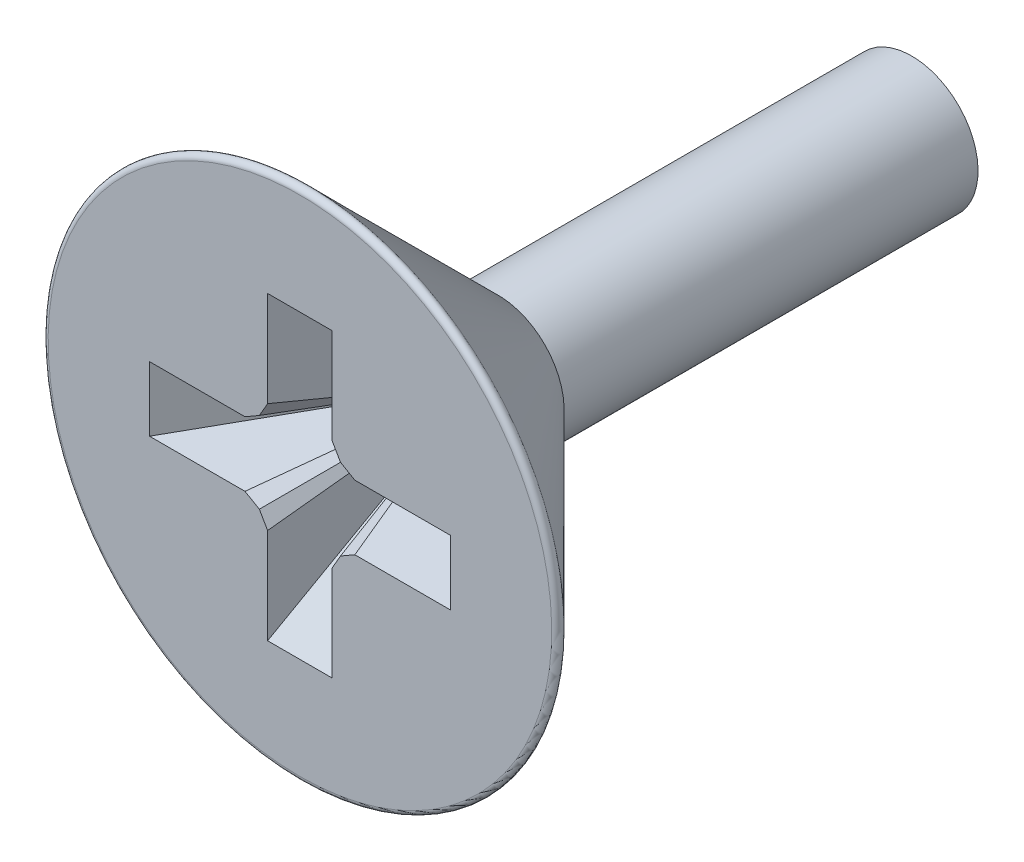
ISO-10303-21;
HEADER;
FILE_DESCRIPTION(('STEP AP214'),'2;1');
FILE_NAME('part.step','',(''),(''),'','','');
FILE_SCHEMA(('AUTOMOTIVE_DESIGN { 1 0 10303 214 1 1 1 1 }'));
ENDSEC;
DATA;
#1=APPLICATION_CONTEXT('core data for automotive mechanical design processes');
#2=APPLICATION_PROTOCOL_DEFINITION('international standard','automotive_design',2000,#1);
#3=PRODUCT_CONTEXT('',#1,'mechanical');
#4=PRODUCT('Part','Part','',(#3));
#5=PRODUCT_RELATED_PRODUCT_CATEGORY('part','',(#4));
#6=PRODUCT_DEFINITION_FORMATION('','',#4);
#7=PRODUCT_DEFINITION_CONTEXT('part definition',#1,'design');
#8=PRODUCT_DEFINITION('design','',#6,#7);
#9=PRODUCT_DEFINITION_SHAPE('','',#8);
#10=(LENGTH_UNIT() NAMED_UNIT(*) SI_UNIT(.MILLI.,.METRE.));
#11=(NAMED_UNIT(*) PLANE_ANGLE_UNIT() SI_UNIT($,.RADIAN.));
#12=(NAMED_UNIT(*) SI_UNIT($,.STERADIAN.) SOLID_ANGLE_UNIT());
#13=UNCERTAINTY_MEASURE_WITH_UNIT(LENGTH_MEASURE(1.E-05),#10,'distance_accuracy_value','');
#14=(GEOMETRIC_REPRESENTATION_CONTEXT(3) GLOBAL_UNCERTAINTY_ASSIGNED_CONTEXT((#13)) GLOBAL_UNIT_ASSIGNED_CONTEXT((#10,
#11,#12)) REPRESENTATION_CONTEXT('',''));
#15=CARTESIAN_POINT('',(0.,0.,0.));
#16=DIRECTION('',(0.,0.,1.));
#17=DIRECTION('',(1.,0.,0.));
#18=AXIS2_PLACEMENT_3D('',#15,#16,#17);
#19=CARTESIAN_POINT('',(0.,0.,-0.0839999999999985));
#20=DIRECTION('',(0.,0.,1.));
#21=DIRECTION('',(0.,-1.,0.));
#22=AXIS2_PLACEMENT_3D('',#19,#20,#21);
#23=TOROIDAL_SURFACE('',#22,4.116,0.0840000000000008);
#24=CARTESIAN_POINT('',(0.,0.,0.));
#25=DIRECTION('',(0.,0.,1.));
#26=DIRECTION('',(0.,-1.,0.));
#27=AXIS2_PLACEMENT_3D('',#24,#25,#26);
#28=CIRCLE('',#27,4.116);
#29=CARTESIAN_POINT('',(0.,-4.116,0.));
#30=VERTEX_POINT('',#29);
#31=EDGE_CURVE('E12',#30,#30,#28,.T.);
#32=ORIENTED_EDGE('',*,*,#31,.F.);
#33=EDGE_LOOP('',(#32));
#34=FACE_BOUND('',#33,.T.);
#35=CARTESIAN_POINT('',(0.,0.,-0.14339696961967));
#36=DIRECTION('',(0.,0.,1.));
#37=DIRECTION('',(0.,-1.,0.));
#38=AXIS2_PLACEMENT_3D('',#35,#36,#37);
#39=CIRCLE('',#38,4.17539696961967);
#40=CARTESIAN_POINT('',(0.,-4.17539696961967,-0.143396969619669));
#41=VERTEX_POINT('',#40);
#42=EDGE_CURVE('E228',#41,#41,#39,.T.);
#43=ORIENTED_EDGE('',*,*,#42,.T.);
#44=EDGE_LOOP('',(#43));
#45=FACE_BOUND('',#44,.T.);
#46=ADVANCED_FACE('F47',(#34,#45),#23,.T.);
#47=CARTESIAN_POINT('',(0.,4.116,0.));
#48=DIRECTION('',(0.,0.,-1.));
#49=DIRECTION('',(0.,1.,0.));
#50=AXIS2_PLACEMENT_3D('',#47,#48,#49);
#51=PLANE('',#50);
#52=DIRECTION('',(0.,1.,0.));
#53=VECTOR('',#52,1.);
#54=CARTESIAN_POINT('',(0.528066,-1.678120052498,0.));
#55=LINE('',#54,#53);
#56=CARTESIAN_POINT('',(0.528066,-2.458527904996,0.));
#57=VERTEX_POINT('',#56);
#58=CARTESIAN_POINT('',(0.528066,-0.8977122,0.));
#59=VERTEX_POINT('',#58);
#60=EDGE_CURVE('E331',#57,#59,#55,.T.);
#61=ORIENTED_EDGE('',*,*,#60,.F.);
#62=DIRECTION('',(1.,0.,0.));
#63=VECTOR('',#62,1.);
#64=CARTESIAN_POINT('',(0.,-2.458527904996,0.));
#65=LINE('',#64,#63);
#66=CARTESIAN_POINT('',(-0.528066,-2.458527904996,0.));
#67=VERTEX_POINT('',#66);
#68=EDGE_CURVE('E334',#67,#57,#65,.T.);
#69=ORIENTED_EDGE('',*,*,#68,.F.);
#70=DIRECTION('',(0.,-1.,0.));
#71=VECTOR('',#70,1.);
#72=CARTESIAN_POINT('',(-0.528066,-1.678120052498,0.));
#73=LINE('',#72,#71);
#74=CARTESIAN_POINT('',(-0.528066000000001,-0.897712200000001,0.));
#75=VERTEX_POINT('',#74);
#76=EDGE_CURVE('E236',#75,#67,#73,.T.);
#77=ORIENTED_EDGE('',*,*,#76,.F.);
#78=DIRECTION('',(0.499999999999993,-0.866025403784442,0.));
#79=VECTOR('',#78,1.);
#80=CARTESIAN_POINT('',(-0.63477366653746,-0.7128891,0.));
#81=LINE('',#80,#79);
#82=CARTESIAN_POINT('',(-0.663365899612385,-0.663365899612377,0.));
#83=VERTEX_POINT('',#82);
#84=EDGE_CURVE('E61',#83,#75,#81,.T.);
#85=ORIENTED_EDGE('',*,*,#84,.F.);
#86=DIRECTION('',(0.866025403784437,-0.500000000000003,0.));
#87=VECTOR('',#86,1.);
#88=CARTESIAN_POINT('',(-0.712889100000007,-0.634773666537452,0.));
#89=LINE('',#88,#87);
#90=CARTESIAN_POINT('',(-0.897712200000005,-0.528065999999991,0.));
#91=VERTEX_POINT('',#90);
#92=EDGE_CURVE('E246',#91,#83,#89,.T.);
#93=ORIENTED_EDGE('',*,*,#92,.F.);
#94=DIRECTION('',(1.,0.,0.));
#95=VECTOR('',#94,1.);
#96=CARTESIAN_POINT('',(-1.678120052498,-0.528065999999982,0.));
#97=LINE('',#96,#95);
#98=CARTESIAN_POINT('',(-2.458527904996,-0.528065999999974,0.));
#99=VERTEX_POINT('',#98);
#100=EDGE_CURVE('E252',#99,#91,#97,.T.);
#101=ORIENTED_EDGE('',*,*,#100,.F.);
#102=DIRECTION('',(0.,-1.,0.));
#103=VECTOR('',#102,1.);
#104=CARTESIAN_POINT('',(-2.458527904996,0.,0.));
#105=LINE('',#104,#103);
#106=CARTESIAN_POINT('',(-2.45852790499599,0.528066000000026,0.));
#107=VERTEX_POINT('',#106);
#108=EDGE_CURVE('E258',#107,#99,#105,.T.);
#109=ORIENTED_EDGE('',*,*,#108,.F.);
#110=DIRECTION('',(-1.,0.,0.));
#111=VECTOR('',#110,1.);
#112=CARTESIAN_POINT('',(-1.67812005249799,0.528066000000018,0.));
#113=LINE('',#112,#111);
#114=CARTESIAN_POINT('',(-0.897712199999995,0.52806600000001,0.));
#115=VERTEX_POINT('',#114);
#116=EDGE_CURVE('E264',#115,#107,#113,.T.);
#117=ORIENTED_EDGE('',*,*,#116,.F.);
#118=DIRECTION('',(-0.866025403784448,-0.499999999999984,0.));
#119=VECTOR('',#118,1.);
#120=CARTESIAN_POINT('',(-0.712889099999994,0.634773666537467,0.));
#121=LINE('',#120,#119);
#122=CARTESIAN_POINT('',(-0.663365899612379,0.663365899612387,0.));
#123=VERTEX_POINT('',#122);
#124=EDGE_CURVE('E206',#123,#115,#121,.T.);
#125=ORIENTED_EDGE('',*,*,#124,.F.);
#126=DIRECTION('',(-0.499999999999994,-0.866025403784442,0.));
#127=VECTOR('',#126,1.);
#128=CARTESIAN_POINT('',(-0.634773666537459,0.7128891,0.));
#129=LINE('',#128,#127);
#130=CARTESIAN_POINT('',(-0.528066,0.8977122,0.));
#131=VERTEX_POINT('',#130);
#132=EDGE_CURVE('E205',#131,#123,#129,.T.);
#133=ORIENTED_EDGE('',*,*,#132,.F.);
#134=DIRECTION('',(0.,-1.,0.));
#135=VECTOR('',#134,1.);
#136=CARTESIAN_POINT('',(-0.528066,1.678120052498,0.));
#137=LINE('',#136,#135);
#138=CARTESIAN_POINT('',(-0.528066,2.458527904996,0.));
#139=VERTEX_POINT('',#138);
#140=EDGE_CURVE('E201',#139,#131,#137,.T.);
#141=ORIENTED_EDGE('',*,*,#140,.F.);
#142=DIRECTION('',(-1.,0.,0.));
#143=VECTOR('',#142,1.);
#144=CARTESIAN_POINT('',(0.,2.458527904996,0.));
#145=LINE('',#144,#143);
#146=CARTESIAN_POINT('',(0.528066,2.458527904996,0.));
#147=VERTEX_POINT('',#146);
#148=EDGE_CURVE('E279',#147,#139,#145,.T.);
#149=ORIENTED_EDGE('',*,*,#148,.F.);
#150=DIRECTION('',(0.,1.,0.));
#151=VECTOR('',#150,1.);
#152=CARTESIAN_POINT('',(0.528066,1.678120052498,0.));
#153=LINE('',#152,#151);
#154=CARTESIAN_POINT('',(0.528066,0.8977122,0.));
#155=VERTEX_POINT('',#154);
#156=EDGE_CURVE('E284',#155,#147,#153,.T.);
#157=ORIENTED_EDGE('',*,*,#156,.F.);
#158=DIRECTION('',(-0.499999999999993,0.866025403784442,0.));
#159=VECTOR('',#158,1.);
#160=CARTESIAN_POINT('',(0.63477366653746,0.7128891,0.));
#161=LINE('',#160,#159);
#162=CARTESIAN_POINT('',(0.663365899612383,0.66336589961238,0.));
#163=VERTEX_POINT('',#162);
#164=EDGE_CURVE('E290',#163,#155,#161,.T.);
#165=ORIENTED_EDGE('',*,*,#164,.F.);
#166=DIRECTION('',(-0.86602540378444,0.499999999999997,0.));
#167=VECTOR('',#166,1.);
#168=CARTESIAN_POINT('',(0.712889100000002,0.634773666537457,0.));
#169=LINE('',#168,#167);
#170=CARTESIAN_POINT('',(0.897712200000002,0.528065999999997,0.));
#171=VERTEX_POINT('',#170);
#172=EDGE_CURVE('E295',#171,#163,#169,.T.);
#173=ORIENTED_EDGE('',*,*,#172,.F.);
#174=DIRECTION('',(-1.,0.,0.));
#175=VECTOR('',#174,1.);
#176=CARTESIAN_POINT('',(1.678120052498,0.528065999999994,0.));
#177=LINE('',#176,#175);
#178=CARTESIAN_POINT('',(2.458527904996,0.528065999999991,0.));
#179=VERTEX_POINT('',#178);
#180=EDGE_CURVE('E301',#179,#171,#177,.T.);
#181=ORIENTED_EDGE('',*,*,#180,.F.);
#182=DIRECTION('',(0.,1.,0.));
#183=VECTOR('',#182,1.);
#184=CARTESIAN_POINT('',(2.458527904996,0.,0.));
#185=LINE('',#184,#183);
#186=CARTESIAN_POINT('',(2.458527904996,-0.528066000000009,0.));
#187=VERTEX_POINT('',#186);
#188=EDGE_CURVE('E307',#187,#179,#185,.T.);
#189=ORIENTED_EDGE('',*,*,#188,.F.);
#190=DIRECTION('',(1.,0.,0.));
#191=VECTOR('',#190,1.);
#192=CARTESIAN_POINT('',(1.678120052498,-0.528066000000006,0.));
#193=LINE('',#192,#191);
#194=CARTESIAN_POINT('',(0.897712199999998,-0.528066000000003,0.));
#195=VERTEX_POINT('',#194);
#196=EDGE_CURVE('E313',#195,#187,#193,.T.);
#197=ORIENTED_EDGE('',*,*,#196,.F.);
#198=DIRECTION('',(0.866025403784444,0.49999999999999,0.));
#199=VECTOR('',#198,1.);
#200=CARTESIAN_POINT('',(0.712889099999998,-0.634773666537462,0.));
#201=LINE('',#200,#199);
#202=CARTESIAN_POINT('',(0.663365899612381,-0.663365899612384,0.));
#203=VERTEX_POINT('',#202);
#204=EDGE_CURVE('E320',#203,#195,#201,.T.);
#205=ORIENTED_EDGE('',*,*,#204,.F.);
#206=DIRECTION('',(0.499999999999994,0.866025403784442,0.));
#207=VECTOR('',#206,1.);
#208=CARTESIAN_POINT('',(0.634773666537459,-0.7128891,0.));
#209=LINE('',#208,#207);
#210=EDGE_CURVE('E326',#59,#203,#209,.T.);
#211=ORIENTED_EDGE('',*,*,#210,.F.);
#212=EDGE_LOOP('',(#61,#69,#77,#85,#93,#101,#109,#117,#125,#133,#141,#149,#157,#165,#173,#181,
#189,#197,#205,#211));
#213=FACE_BOUND('',#212,.T.);
#214=ORIENTED_EDGE('',*,*,#31,.T.);
#215=EDGE_LOOP('',(#214));
#216=FACE_BOUND('',#215,.T.);
#217=ADVANCED_FACE('F349',(#213,#216),#51,.F.);
#218=CARTESIAN_POINT('',(0.,0.,-10.));
#219=DIRECTION('',(0.,0.,1.));
#220=DIRECTION('',(0.,-1.,0.));
#221=AXIS2_PLACEMENT_3D('',#218,#219,#220);
#222=PLANE('',#221);
#223=CARTESIAN_POINT('',(0.,0.,-10.));
#224=DIRECTION('',(0.,0.,1.));
#225=DIRECTION('',(0.,-1.,0.));
#226=AXIS2_PLACEMENT_3D('',#223,#224,#225);
#227=CIRCLE('',#226,1.08499999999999);
#228=CARTESIAN_POINT('',(0.,-1.08499999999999,-10.));
#229=VERTEX_POINT('',#228);
#230=EDGE_CURVE('E54',#229,#229,#227,.T.);
#231=ORIENTED_EDGE('',*,*,#230,.F.);
#232=EDGE_LOOP('',(#231));
#233=FACE_BOUND('',#232,.T.);
#234=ADVANCED_FACE('F347',(#233),#222,.F.);
#235=CARTESIAN_POINT('',(0.,0.,0.));
#236=DIRECTION('',(0.,0.,1.));
#237=DIRECTION('',(0.,-1.,0.));
#238=AXIS2_PLACEMENT_3D('',#235,#236,#237);
#239=CYLINDRICAL_SURFACE('',#238,1.08499999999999);
#240=CARTESIAN_POINT('',(0.,0.,-3.23379393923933));
#241=DIRECTION('',(0.,0.,1.));
#242=DIRECTION('',(0.,-1.,0.));
#243=AXIS2_PLACEMENT_3D('',#240,#241,#242);
#244=CIRCLE('',#243,1.08499999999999);
#245=CARTESIAN_POINT('',(0.,-1.08499999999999,-3.23379393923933));
#246=VERTEX_POINT('',#245);
#247=EDGE_CURVE('E340',#246,#246,#244,.T.);
#248=ORIENTED_EDGE('',*,*,#247,.F.);
#249=EDGE_LOOP('',(#248));
#250=FACE_BOUND('',#249,.T.);
#251=ORIENTED_EDGE('',*,*,#230,.T.);
#252=EDGE_LOOP('',(#251));
#253=FACE_BOUND('',#252,.T.);
#254=ADVANCED_FACE('F345',(#250,#253),#239,.T.);
#255=CARTESIAN_POINT('',(0.,0.,-3.23379393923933));
#256=DIRECTION('',(0.,0.,1.));
#257=DIRECTION('',(0.,-1.,0.));
#258=AXIS2_PLACEMENT_3D('',#255,#256,#257);
#259=CONICAL_SURFACE('',#258,1.08499999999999,0.78539816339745);
#260=CARTESIAN_POINT('',(0.,-4.17539696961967,-0.143396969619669));
#261=CARTESIAN_POINT('',(0.,-4.14320533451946,-0.175588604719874));
#262=CARTESIAN_POINT('',(0.,-4.11101369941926,-0.207780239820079));
#263=CARTESIAN_POINT('',(0.,-4.04663042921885,-0.272163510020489));
#264=CARTESIAN_POINT('',(0.,-4.01443879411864,-0.304355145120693));
#265=CARTESIAN_POINT('',(0.,-3.95005552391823,-0.368738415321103));
#266=CARTESIAN_POINT('',(0.,-3.91786388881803,-0.400930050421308));
#267=CARTESIAN_POINT('',(0.,-3.85348061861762,-0.465313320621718));
#268=CARTESIAN_POINT('',(0.,-3.82128898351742,-0.497504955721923));
#269=CARTESIAN_POINT('',(0.,-3.756905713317,-0.561888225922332));
#270=CARTESIAN_POINT('',(0.,-3.7247140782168,-0.594079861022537));
#271=CARTESIAN_POINT('',(0.,-3.66033080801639,-0.658463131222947));
#272=CARTESIAN_POINT('',(0.,-3.62813917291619,-0.690654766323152));
#273=CARTESIAN_POINT('',(0.,-3.56375590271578,-0.755038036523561));
#274=CARTESIAN_POINT('',(0.,-3.53156426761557,-0.787229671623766));
#275=CARTESIAN_POINT('',(0.,-3.46718099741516,-0.851612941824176));
#276=CARTESIAN_POINT('',(0.,-3.43498936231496,-0.883804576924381));
#277=CARTESIAN_POINT('',(0.,-3.37060609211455,-0.94818784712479));
#278=CARTESIAN_POINT('',(0.,-3.33841445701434,-0.980379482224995));
#279=CARTESIAN_POINT('',(0.,-3.27403118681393,-1.0447627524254));
#280=CARTESIAN_POINT('',(0.,-3.24183955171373,-1.07695438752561));
#281=CARTESIAN_POINT('',(0.,-3.17745628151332,-1.14133765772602));
#282=CARTESIAN_POINT('',(0.,-3.14526464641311,-1.17352929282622));
#283=CARTESIAN_POINT('',(0.,-3.0808813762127,-1.23791256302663));
#284=CARTESIAN_POINT('',(0.,-3.0486897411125,-1.27010419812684));
#285=CARTESIAN_POINT('',(0.,-2.98430647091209,-1.33448746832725));
#286=CARTESIAN_POINT('',(0.,-2.95211483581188,-1.36667910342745));
#287=CARTESIAN_POINT('',(0.,-2.88773156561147,-1.43106237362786));
#288=CARTESIAN_POINT('',(0.,-2.85553993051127,-1.46325400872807));
#289=CARTESIAN_POINT('',(0.,-2.79115666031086,-1.52763727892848));
#290=CARTESIAN_POINT('',(0.,-2.75896502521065,-1.55982891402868));
#291=CARTESIAN_POINT('',(0.,-2.69458175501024,-1.62421218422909));
#292=CARTESIAN_POINT('',(0.,-2.66239011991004,-1.6564038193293));
#293=CARTESIAN_POINT('',(0.,-2.59800684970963,-1.72078708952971));
#294=CARTESIAN_POINT('',(0.,-2.56581521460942,-1.75297872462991));
#295=CARTESIAN_POINT('',(0.,-2.50143194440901,-1.81736199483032));
#296=CARTESIAN_POINT('',(0.,-2.46924030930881,-1.84955362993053));
#297=CARTESIAN_POINT('',(0.,-2.4048570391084,-1.91393690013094));
#298=CARTESIAN_POINT('',(0.,-2.37266540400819,-1.94612853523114));
#299=CARTESIAN_POINT('',(0.,-2.30828213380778,-2.01051180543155));
#300=CARTESIAN_POINT('',(0.,-2.27609049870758,-2.04270344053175));
#301=CARTESIAN_POINT('',(0.,-2.21170722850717,-2.10708671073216));
#302=CARTESIAN_POINT('',(0.,-2.17951559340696,-2.13927834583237));
#303=CARTESIAN_POINT('',(0.,-2.11513232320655,-2.20366161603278));
#304=CARTESIAN_POINT('',(0.,-2.08294068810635,-2.23585325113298));
#305=CARTESIAN_POINT('',(0.,-2.01855741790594,-2.30023652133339));
#306=CARTESIAN_POINT('',(0.,-1.98636578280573,-2.3324281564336));
#307=CARTESIAN_POINT('',(0.,-1.92198251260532,-2.39681142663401));
#308=CARTESIAN_POINT('',(0.,-1.88979087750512,-2.42900306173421));
#309=CARTESIAN_POINT('',(0.,-1.82540760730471,-2.49338633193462));
#310=CARTESIAN_POINT('',(0.,-1.7932159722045,-2.52557796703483));
#311=CARTESIAN_POINT('',(0.,-1.72883270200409,-2.58996123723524));
#312=CARTESIAN_POINT('',(0.,-1.69664106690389,-2.62215287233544));
#313=CARTESIAN_POINT('',(0.,-1.63225779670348,-2.68653614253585));
#314=CARTESIAN_POINT('',(0.,-1.60006616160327,-2.71872777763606));
#315=CARTESIAN_POINT('',(0.,-1.53568289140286,-2.78311104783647));
#316=CARTESIAN_POINT('',(0.,-1.50349125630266,-2.81530268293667));
#317=CARTESIAN_POINT('',(0.,-1.43910798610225,-2.87968595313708));
#318=CARTESIAN_POINT('',(0.,-1.40691635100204,-2.91187758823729));
#319=CARTESIAN_POINT('',(0.,-1.34253308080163,-2.97626085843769));
#320=CARTESIAN_POINT('',(0.,-1.31034144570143,-3.0084524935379));
#321=CARTESIAN_POINT('',(0.,-1.24595817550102,-3.07283576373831));
#322=CARTESIAN_POINT('',(0.,-1.21376654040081,-3.10502739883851));
#323=CARTESIAN_POINT('',(0.,-1.1493832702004,-3.16941066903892));
#324=CARTESIAN_POINT('',(0.,-1.1171916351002,-3.20160230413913));
#325=CARTESIAN_POINT('',(0.,-1.08499999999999,-3.23379393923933));
#326=B_SPLINE_CURVE_WITH_KNOTS('',3,(#260,#261,#262,#263,#264,#265,#266,#267,#268,#269,#270,
#271,#272,#273,#274,#275,#276,#277,#278,#279,#280,#281,#282,#283,#284,#285,#286,#287,#288,#289,
#290,#291,#292,#293,#294,#295,#296,#297,#298,#299,#300,#301,#302,#303,#304,#305,#306,#307,#308,
#309,#310,#311,#312,#313,#314,#315,#316,#317,#318,#319,#320,#321,#322,#323,#324,#325),
.UNSPECIFIED.,.F.,.F.,(4,2,2,2,2,2,2,2,2,2,2,2,2,2,2,2,2,2,2,2,2,2,2,2,2,2,2,2,2,2,2,2,4),(0.,
0.136577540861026,0.273155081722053,0.409732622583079,0.546310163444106,0.682887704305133,
0.819465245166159,0.956042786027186,1.09262032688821,1.22919786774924,1.36577540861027,
1.50235294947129,1.63893049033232,1.77550803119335,1.91208557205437,2.0486631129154,
2.18524065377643,2.32181819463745,2.45839573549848,2.5949732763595,2.73155081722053,
2.86812835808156,3.00470589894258,3.14128343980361,3.27786098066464,3.41443852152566,
3.55101606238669,3.68759360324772,3.82417114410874,3.96074868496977,4.0973262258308,
4.23390376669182,4.37048130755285),.UNSPECIFIED.);
#327=EDGE_CURVE('BSEAM355',#41,#246,#326,.T.);
#328=ORIENTED_EDGE('',*,*,#42,.F.);
#329=ORIENTED_EDGE('',*,*,#247,.T.);
#330=ORIENTED_EDGE('',*,*,#327,.T.);
#331=ORIENTED_EDGE('',*,*,#327,.F.);
#332=EDGE_LOOP('',(#328,#330,#329,#331));
#333=FACE_BOUND('',#332,.T.);
#334=ADVANCED_FACE('F355',(#333),#259,.T.);
#335=CARTESIAN_POINT('',(0.,0.,-3.42103836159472));
#336=DIRECTION('',(0.,-1.,0.));
#337=DIRECTION('',(0.,0.,1.));
#338=AXIS2_PLACEMENT_3D('',#335,#336,#337);
#339=SPHERICAL_SURFACE('',#338,1.10103836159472);
#340=CARTESIAN_POINT('',(-0.091831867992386,0.,-3.40431653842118));
#341=DIRECTION('',(0.983822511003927,0.,-0.179145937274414));
#342=DIRECTION('',(-0.179145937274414,0.,-0.983822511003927));
#343=AXIS2_PLACEMENT_3D('',#340,#341,#342);
#344=CIRCLE('',#343,1.09707463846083);
#345=CARTESIAN_POINT('',(0.0898547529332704,0.418338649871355,-2.40654125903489));
#346=VERTEX_POINT('',#345);
#347=CARTESIAN_POINT('',(0.102223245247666,0.173779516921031,-2.33861674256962));
#348=VERTEX_POINT('',#347);
#349=EDGE_CURVE('E337',#346,#348,#344,.T.);
#350=ORIENTED_EDGE('',*,*,#349,.F.);
#351=CARTESIAN_POINT('',(0.,-0.257006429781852,-3.20315647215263));
#352=DIRECTION('',(0.,0.762778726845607,-0.646659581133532));
#353=DIRECTION('',(0.,0.646659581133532,0.762778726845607));
#354=AXIS2_PLACEMENT_3D('',#351,#352,#353);
#355=CIRCLE('',#354,1.04821784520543);
#356=CARTESIAN_POINT('',(-0.0898547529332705,0.418338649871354,-2.40654125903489));
#357=VERTEX_POINT('',#356);
#358=EDGE_CURVE('E220',#357,#346,#355,.T.);
#359=ORIENTED_EDGE('',*,*,#358,.F.);
#360=CARTESIAN_POINT('',(0.0918318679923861,0.,-3.40431653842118));
#361=DIRECTION('',(-0.983822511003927,0.,-0.179145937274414));
#362=DIRECTION('',(-0.179145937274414,0.,0.983822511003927));
#363=AXIS2_PLACEMENT_3D('',#360,#361,#362);
#364=CIRCLE('',#363,1.09707463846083);
#365=CARTESIAN_POINT('',(-0.102223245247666,0.173779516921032,-2.33861674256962));
#366=VERTEX_POINT('',#365);
#367=EDGE_CURVE('E198',#366,#357,#364,.T.);
#368=ORIENTED_EDGE('',*,*,#367,.F.);
#369=CARTESIAN_POINT('',(0.128455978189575,-0.0741640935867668,-3.37468965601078));
#370=DIRECTION('',(-0.82661002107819,0.477243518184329,-0.298252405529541));
#371=DIRECTION('',(-0.499999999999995,-0.866025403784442,0.));
#372=AXIS2_PLACEMENT_3D('',#369,#370,#371);
#373=CIRCLE('',#372,1.09001652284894);
#374=CARTESIAN_POINT('',(-0.129181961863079,0.129181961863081,-2.33526236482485));
#375=VERTEX_POINT('',#374);
#376=EDGE_CURVE('E209',#375,#366,#373,.T.);
#377=ORIENTED_EDGE('',*,*,#376,.F.);
#378=CARTESIAN_POINT('',(0.0741640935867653,-0.128455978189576,-3.37468965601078));
#379=DIRECTION('',(-0.47724351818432,0.826610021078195,-0.298252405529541));
#380=DIRECTION('',(-0.866025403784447,-0.499999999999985,0.));
#381=AXIS2_PLACEMENT_3D('',#378,#379,#380);
#382=CIRCLE('',#381,1.09001652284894);
#383=CARTESIAN_POINT('',(-0.17377951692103,0.102223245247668,-2.33861674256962));
#384=VERTEX_POINT('',#383);
#385=EDGE_CURVE('E216',#384,#375,#382,.T.);
#386=ORIENTED_EDGE('',*,*,#385,.F.);
#387=CARTESIAN_POINT('',(0.,-0.0918318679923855,-3.40431653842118));
#388=DIRECTION('',(0.,0.983822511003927,-0.179145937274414));
#389=DIRECTION('',(0.,0.179145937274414,0.983822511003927));
#390=AXIS2_PLACEMENT_3D('',#387,#388,#389);
#391=CIRCLE('',#390,1.09707463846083);
#392=CARTESIAN_POINT('',(-0.418338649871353,0.0898547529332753,-2.40654125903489));
#393=VERTEX_POINT('',#392);
#394=EDGE_CURVE('E491',#393,#384,#391,.T.);
#395=ORIENTED_EDGE('',*,*,#394,.F.);
#396=CARTESIAN_POINT('',(0.257006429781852,0.,-3.20315647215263));
#397=DIRECTION('',(-0.762778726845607,0.,-0.646659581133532));
#398=DIRECTION('',(-0.646659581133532,0.,0.762778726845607));
#399=AXIS2_PLACEMENT_3D('',#396,#397,#398);
#400=CIRCLE('',#399,1.04821784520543);
#401=CARTESIAN_POINT('',(-0.418338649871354,-0.0898547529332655,-2.40654125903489));
#402=VERTEX_POINT('',#401);
#403=EDGE_CURVE('E487',#402,#393,#400,.T.);
#404=ORIENTED_EDGE('',*,*,#403,.F.);
#405=CARTESIAN_POINT('',(0.,0.091831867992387,-3.40431653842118));
#406=DIRECTION('',(0.,-0.983822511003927,-0.179145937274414));
#407=DIRECTION('',(0.,0.179145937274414,-0.983822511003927));
#408=AXIS2_PLACEMENT_3D('',#405,#406,#407);
#409=CIRCLE('',#408,1.09707463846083);
#410=CARTESIAN_POINT('',(-0.173779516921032,-0.102223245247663,-2.33861674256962));
#411=VERTEX_POINT('',#410);
#412=EDGE_CURVE('E483',#411,#402,#409,.T.);
#413=ORIENTED_EDGE('',*,*,#412,.F.);
#414=CARTESIAN_POINT('',(0.0741640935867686,0.128455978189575,-3.37468965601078));
#415=DIRECTION('',(-0.477243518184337,-0.826610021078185,-0.298252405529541));
#416=DIRECTION('',(0.866025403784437,-0.500000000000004,0.));
#417=AXIS2_PLACEMENT_3D('',#414,#415,#416);
#418=CIRCLE('',#417,1.09001652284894);
#419=CARTESIAN_POINT('',(-0.12918196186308,-0.129181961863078,-2.33526236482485));
#420=VERTEX_POINT('',#419);
#421=EDGE_CURVE('E476',#420,#411,#418,.T.);
#422=ORIENTED_EDGE('',*,*,#421,.F.);
#423=CARTESIAN_POINT('',(0.128455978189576,0.0741640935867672,-3.37468965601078));
#424=DIRECTION('',(-0.82661002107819,-0.477243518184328,-0.298252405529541));
#425=DIRECTION('',(0.499999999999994,-0.866025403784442,0.));
#426=AXIS2_PLACEMENT_3D('',#423,#424,#425);
#427=CIRCLE('',#426,1.09001652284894);
#428=CARTESIAN_POINT('',(-0.102223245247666,-0.173779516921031,-2.33861674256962));
#429=VERTEX_POINT('',#428);
#430=EDGE_CURVE('E469',#429,#420,#427,.T.);
#431=ORIENTED_EDGE('',*,*,#430,.F.);
#432=CARTESIAN_POINT('',(0.091831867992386,0.,-3.40431653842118));
#433=DIRECTION('',(-0.983822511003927,0.,-0.179145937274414));
#434=DIRECTION('',(-0.179145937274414,0.,0.983822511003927));
#435=AXIS2_PLACEMENT_3D('',#432,#433,#434);
#436=CIRCLE('',#435,1.09707463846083);
#437=CARTESIAN_POINT('',(-0.0898547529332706,-0.418338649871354,-2.40654125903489));
#438=VERTEX_POINT('',#437);
#439=EDGE_CURVE('E453',#438,#429,#436,.T.);
#440=ORIENTED_EDGE('',*,*,#439,.F.);
#441=CARTESIAN_POINT('',(0.,0.257006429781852,-3.20315647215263));
#442=DIRECTION('',(0.,-0.762778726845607,-0.646659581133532));
#443=DIRECTION('',(0.,0.646659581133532,-0.762778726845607));
#444=AXIS2_PLACEMENT_3D('',#441,#442,#443);
#445=CIRCLE('',#444,1.04821784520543);
#446=CARTESIAN_POINT('',(0.0898547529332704,-0.418338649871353,-2.40654125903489));
#447=VERTEX_POINT('',#446);
#448=EDGE_CURVE('E463',#447,#438,#445,.T.);
#449=ORIENTED_EDGE('',*,*,#448,.F.);
#450=CARTESIAN_POINT('',(-0.0918318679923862,0.,-3.40431653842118));
#451=DIRECTION('',(0.983822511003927,0.,-0.179145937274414));
#452=DIRECTION('',(-0.179145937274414,0.,-0.983822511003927));
#453=AXIS2_PLACEMENT_3D('',#450,#451,#452);
#454=CIRCLE('',#453,1.09707463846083);
#455=CARTESIAN_POINT('',(0.102223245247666,-0.173779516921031,-2.33861674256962));
#456=VERTEX_POINT('',#455);
#457=EDGE_CURVE('E466',#456,#447,#454,.T.);
#458=ORIENTED_EDGE('',*,*,#457,.F.);
#459=CARTESIAN_POINT('',(-0.128455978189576,0.0741640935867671,-3.37468965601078));
#460=DIRECTION('',(0.82661002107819,-0.477243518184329,-0.298252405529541));
#461=DIRECTION('',(0.499999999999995,0.866025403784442,0.));
#462=AXIS2_PLACEMENT_3D('',#459,#460,#461);
#463=CIRCLE('',#462,1.09001652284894);
#464=CARTESIAN_POINT('',(0.129181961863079,-0.12918196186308,-2.33526236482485));
#465=VERTEX_POINT('',#464);
#466=EDGE_CURVE('E529',#465,#456,#463,.T.);
#467=ORIENTED_EDGE('',*,*,#466,.F.);
#468=CARTESIAN_POINT('',(-0.0741640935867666,0.128455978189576,-3.37468965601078));
#469=DIRECTION('',(0.477243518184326,-0.826610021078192,-0.298252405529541));
#470=DIRECTION('',(0.866025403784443,0.499999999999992,0.));
#471=AXIS2_PLACEMENT_3D('',#468,#469,#470);
#472=CIRCLE('',#471,1.09001652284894);
#473=CARTESIAN_POINT('',(0.173779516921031,-0.102223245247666,-2.33861674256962));
#474=VERTEX_POINT('',#473);
#475=EDGE_CURVE('E526',#474,#465,#472,.T.);
#476=ORIENTED_EDGE('',*,*,#475,.F.);
#477=CARTESIAN_POINT('',(0.,0.0918318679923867,-3.40431653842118));
#478=DIRECTION('',(0.,-0.983822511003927,-0.179145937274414));
#479=DIRECTION('',(0.,0.179145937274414,-0.983822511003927));
#480=AXIS2_PLACEMENT_3D('',#477,#478,#479);
#481=CIRCLE('',#480,1.09707463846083);
#482=CARTESIAN_POINT('',(0.418338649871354,-0.0898547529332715,-2.40654125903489));
#483=VERTEX_POINT('',#482);
#484=EDGE_CURVE('E523',#483,#474,#481,.T.);
#485=ORIENTED_EDGE('',*,*,#484,.F.);
#486=CARTESIAN_POINT('',(-0.257006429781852,0.,-3.20315647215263));
#487=DIRECTION('',(0.762778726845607,0.,-0.646659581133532));
#488=DIRECTION('',(-0.646659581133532,0.,-0.762778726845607));
#489=AXIS2_PLACEMENT_3D('',#486,#487,#488);
#490=CIRCLE('',#489,1.04821784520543);
#491=CARTESIAN_POINT('',(0.418338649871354,0.0898547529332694,-2.40654125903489));
#492=VERTEX_POINT('',#491);
#493=EDGE_CURVE('E541',#492,#483,#490,.T.);
#494=ORIENTED_EDGE('',*,*,#493,.F.);
#495=CARTESIAN_POINT('',(0.,-0.0918318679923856,-3.40431653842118));
#496=DIRECTION('',(0.,0.983822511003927,-0.179145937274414));
#497=DIRECTION('',(0.,0.179145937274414,0.983822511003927));
#498=AXIS2_PLACEMENT_3D('',#495,#496,#497);
#499=CIRCLE('',#498,1.09707463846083);
#500=CARTESIAN_POINT('',(0.173779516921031,0.102223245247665,-2.33861674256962));
#501=VERTEX_POINT('',#500);
#502=EDGE_CURVE('E516',#501,#492,#499,.T.);
#503=ORIENTED_EDGE('',*,*,#502,.F.);
#504=CARTESIAN_POINT('',(-0.0741640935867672,-0.128455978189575,-3.37468965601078));
#505=DIRECTION('',(0.477243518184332,0.826610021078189,-0.298252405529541));
#506=DIRECTION('',(-0.86602540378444,0.499999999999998,0.));
#507=AXIS2_PLACEMENT_3D('',#504,#505,#506);
#508=CIRCLE('',#507,1.09001652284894);
#509=CARTESIAN_POINT('',(0.12918196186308,0.129181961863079,-2.33526236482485));
#510=VERTEX_POINT('',#509);
#511=EDGE_CURVE('E513',#510,#501,#508,.T.);
#512=ORIENTED_EDGE('',*,*,#511,.F.);
#513=CARTESIAN_POINT('',(-0.128455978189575,-0.0741640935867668,-3.37468965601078));
#514=DIRECTION('',(0.82661002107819,0.477243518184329,-0.298252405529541));
#515=DIRECTION('',(-0.499999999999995,0.866025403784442,0.));
#516=AXIS2_PLACEMENT_3D('',#513,#514,#515);
#517=CIRCLE('',#516,1.09001652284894);
#518=EDGE_CURVE('E548',#348,#510,#517,.T.);
#519=ORIENTED_EDGE('',*,*,#518,.F.);
#520=EDGE_LOOP('',(#350,#359,#368,#377,#386,#395,#404,#413,#422,#431,#440,#449,#458,#467,#476,
#485,#494,#503,#512,#519));
#521=FACE_BOUND('',#520,.T.);
#522=ADVANCED_FACE('F219',(#521),#339,.T.);
#523=CARTESIAN_POINT('',(-0.528066,-2.458527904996,0.));
#524=DIRECTION('',(0.,-0.762778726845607,-0.646659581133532));
#525=DIRECTION('',(0.137574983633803,0.640510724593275,-0.7555257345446));
#526=AXIS2_PLACEMENT_3D('',#523,#524,#525);
#527=PLANE('',#526);
#528=DIRECTION('',(0.137574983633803,0.640510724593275,-0.7555257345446));
#529=VECTOR('',#528,1.);
#530=CARTESIAN_POINT('',(-0.264033,-1.229263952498,-1.45));
#531=LINE('',#530,#529);
#532=EDGE_CURVE('E234',#67,#438,#531,.T.);
#533=ORIENTED_EDGE('',*,*,#532,.F.);
#534=ORIENTED_EDGE('',*,*,#68,.T.);
#535=DIRECTION('',(-0.137574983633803,0.640510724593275,-0.7555257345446));
#536=VECTOR('',#535,1.);
#537=CARTESIAN_POINT('',(0.264033,-1.229263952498,-1.45));
#538=LINE('',#537,#536);
#539=EDGE_CURVE('E135',#57,#447,#538,.T.);
#540=ORIENTED_EDGE('',*,*,#539,.T.);
#541=ORIENTED_EDGE('',*,*,#448,.T.);
#542=EDGE_LOOP('',(#533,#534,#540,#541));
#543=FACE_BOUND('',#542,.T.);
#544=ADVANCED_FACE('F374',(#543),#527,.F.);
#545=CARTESIAN_POINT('',(0.528066,-2.458527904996,0.));
#546=DIRECTION('',(0.983822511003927,0.,-0.179145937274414));
#547=DIRECTION('',(-0.137574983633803,0.640510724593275,-0.7555257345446));
#548=AXIS2_PLACEMENT_3D('',#545,#546,#547);
#549=PLANE('',#548);
#550=ORIENTED_EDGE('',*,*,#539,.F.);
#551=ORIENTED_EDGE('',*,*,#60,.T.);
#552=DIRECTION('',(-0.171374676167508,0.291336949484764,-0.941144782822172));
#553=VECTOR('',#552,1.);
#554=CARTESIAN_POINT('',(0.264033,-0.448856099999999,-1.45));
#555=LINE('',#554,#553);
#556=EDGE_CURVE('E324',#59,#456,#555,.T.);
#557=ORIENTED_EDGE('',*,*,#556,.T.);
#558=ORIENTED_EDGE('',*,*,#457,.T.);
#559=EDGE_LOOP('',(#550,#551,#557,#558));
#560=FACE_BOUND('',#559,.T.);
#561=ADVANCED_FACE('F379',(#560),#549,.F.);
#562=CARTESIAN_POINT('',(0.528066,-0.8977122,0.));
#563=DIRECTION('',(0.82661002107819,-0.477243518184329,-0.298252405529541));
#564=DIRECTION('',(-0.171374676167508,0.291336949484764,-0.941144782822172));
#565=AXIS2_PLACEMENT_3D('',#562,#563,#564);
#566=PLANE('',#565);
#567=ORIENTED_EDGE('',*,*,#556,.F.);
#568=ORIENTED_EDGE('',*,*,#210,.T.);
#569=DIRECTION('',(-0.217642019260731,0.217642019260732,-0.951453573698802));
#570=VECTOR('',#569,1.);
#571=CARTESIAN_POINT('',(0.668057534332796,-0.668057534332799,0.020510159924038));
#572=LINE('',#571,#570);
#573=EDGE_CURVE('E317',#203,#465,#572,.T.);
#574=ORIENTED_EDGE('',*,*,#573,.T.);
#575=ORIENTED_EDGE('',*,*,#466,.T.);
#576=EDGE_LOOP('',(#567,#568,#574,#575));
#577=FACE_BOUND('',#576,.T.);
#578=ADVANCED_FACE('F383',(#577),#566,.F.);
#579=CARTESIAN_POINT('',(0.528065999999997,-0.741481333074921,0.));
#580=DIRECTION('',(0.477243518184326,-0.826610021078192,-0.298252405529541));
#581=DIRECTION('',(-0.173733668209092,0.243947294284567,-0.954099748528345));
#582=AXIS2_PLACEMENT_3D('',#579,#580,#581);
#583=PLANE('',#582);
#584=ORIENTED_EDGE('',*,*,#573,.F.);
#585=ORIENTED_EDGE('',*,*,#204,.T.);
#586=DIRECTION('',(-0.291336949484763,0.171374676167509,-0.941144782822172));
#587=VECTOR('',#586,1.);
#588=CARTESIAN_POINT('',(0.448856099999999,-0.264033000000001,-1.45));
#589=LINE('',#588,#587);
#590=EDGE_CURVE('E311',#195,#474,#589,.T.);
#591=ORIENTED_EDGE('',*,*,#590,.T.);
#592=ORIENTED_EDGE('',*,*,#475,.T.);
#593=EDGE_LOOP('',(#584,#585,#591,#592));
#594=FACE_BOUND('',#593,.T.);
#595=ADVANCED_FACE('F386',(#594),#583,.F.);
#596=CARTESIAN_POINT('',(0.897712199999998,-0.528066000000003,0.));
#597=DIRECTION('',(0.,-0.983822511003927,-0.179145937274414));
#598=DIRECTION('',(-0.291336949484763,0.171374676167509,-0.941144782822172));
#599=AXIS2_PLACEMENT_3D('',#596,#597,#598);
#600=PLANE('',#599);
#601=ORIENTED_EDGE('',*,*,#590,.F.);
#602=ORIENTED_EDGE('',*,*,#196,.T.);
#603=DIRECTION('',(-0.640510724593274,0.137574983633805,-0.7555257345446));
#604=VECTOR('',#603,1.);
#605=CARTESIAN_POINT('',(1.229263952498,-0.264033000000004,-1.45));
#606=LINE('',#605,#604);
#607=EDGE_CURVE('E305',#187,#483,#606,.T.);
#608=ORIENTED_EDGE('',*,*,#607,.T.);
#609=ORIENTED_EDGE('',*,*,#484,.T.);
#610=EDGE_LOOP('',(#601,#602,#608,#609));
#611=FACE_BOUND('',#610,.T.);
#612=ADVANCED_FACE('F390',(#611),#600,.F.);
#613=CARTESIAN_POINT('',(2.458527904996,-0.528066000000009,0.));
#614=DIRECTION('',(0.762778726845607,0.,-0.646659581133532));
#615=DIRECTION('',(-0.640510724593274,0.137574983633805,-0.7555257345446));
#616=AXIS2_PLACEMENT_3D('',#613,#614,#615);
#617=PLANE('',#616);
#618=ORIENTED_EDGE('',*,*,#607,.F.);
#619=ORIENTED_EDGE('',*,*,#188,.T.);
#620=DIRECTION('',(-0.640510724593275,-0.137574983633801,-0.7555257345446));
#621=VECTOR('',#620,1.);
#622=CARTESIAN_POINT('',(1.229263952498,0.264032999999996,-1.45));
#623=LINE('',#622,#621);
#624=EDGE_CURVE('E299',#179,#492,#623,.T.);
#625=ORIENTED_EDGE('',*,*,#624,.T.);
#626=ORIENTED_EDGE('',*,*,#493,.T.);
#627=EDGE_LOOP('',(#618,#619,#625,#626));
#628=FACE_BOUND('',#627,.T.);
#629=ADVANCED_FACE('F394',(#628),#617,.F.);
#630=CARTESIAN_POINT('',(2.458527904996,0.528065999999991,0.));
#631=DIRECTION('',(0.,0.983822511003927,-0.179145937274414));
#632=DIRECTION('',(-0.640510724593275,-0.137574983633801,-0.7555257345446));
#633=AXIS2_PLACEMENT_3D('',#630,#631,#632);
#634=PLANE('',#633);
#635=ORIENTED_EDGE('',*,*,#624,.F.);
#636=ORIENTED_EDGE('',*,*,#180,.T.);
#637=DIRECTION('',(-0.291336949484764,-0.171374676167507,-0.941144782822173));
#638=VECTOR('',#637,1.);
#639=CARTESIAN_POINT('',(0.448856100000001,0.264032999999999,-1.45));
#640=LINE('',#639,#638);
#641=EDGE_CURVE('E293',#171,#501,#640,.T.);
#642=ORIENTED_EDGE('',*,*,#641,.T.);
#643=ORIENTED_EDGE('',*,*,#502,.T.);
#644=EDGE_LOOP('',(#635,#636,#642,#643));
#645=FACE_BOUND('',#644,.T.);
#646=ADVANCED_FACE('F398',(#645),#634,.F.);
#647=CARTESIAN_POINT('',(0.897712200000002,0.528065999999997,0.));
#648=DIRECTION('',(0.477243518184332,0.826610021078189,-0.298252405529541));
#649=DIRECTION('',(-0.291336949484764,-0.171374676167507,-0.941144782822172));
#650=AXIS2_PLACEMENT_3D('',#647,#648,#649);
#651=PLANE('',#650);
#652=ORIENTED_EDGE('',*,*,#641,.F.);
#653=ORIENTED_EDGE('',*,*,#172,.T.);
#654=DIRECTION('',(-0.217642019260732,-0.217642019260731,-0.951453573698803));
#655=VECTOR('',#654,1.);
#656=CARTESIAN_POINT('',(0.668057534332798,0.668057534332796,0.0205101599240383));
#657=LINE('',#656,#655);
#658=EDGE_CURVE('E287',#163,#510,#657,.T.);
#659=ORIENTED_EDGE('',*,*,#658,.T.);
#660=ORIENTED_EDGE('',*,*,#511,.T.);
#661=EDGE_LOOP('',(#652,#653,#659,#660));
#662=FACE_BOUND('',#661,.T.);
#663=ADVANCED_FACE('F402',(#662),#651,.F.);
#664=CARTESIAN_POINT('',(0.741481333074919,0.528066,0.));
#665=DIRECTION('',(0.82661002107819,0.477243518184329,-0.298252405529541));
#666=DIRECTION('',(-0.243947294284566,-0.173733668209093,-0.954099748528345));
#667=AXIS2_PLACEMENT_3D('',#664,#665,#666);
#668=PLANE('',#667);
#669=ORIENTED_EDGE('',*,*,#658,.F.);
#670=ORIENTED_EDGE('',*,*,#164,.T.);
#671=DIRECTION('',(-0.171374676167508,-0.291336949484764,-0.941144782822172));
#672=VECTOR('',#671,1.);
#673=CARTESIAN_POINT('',(0.264033,0.4488561,-1.45));
#674=LINE('',#673,#672);
#675=EDGE_CURVE('E143',#155,#348,#674,.T.);
#676=ORIENTED_EDGE('',*,*,#675,.T.);
#677=ORIENTED_EDGE('',*,*,#518,.T.);
#678=EDGE_LOOP('',(#669,#670,#676,#677));
#679=FACE_BOUND('',#678,.T.);
#680=ADVANCED_FACE('F406',(#679),#668,.F.);
#681=CARTESIAN_POINT('',(0.528066,0.8977122,0.));
#682=DIRECTION('',(0.983822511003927,0.,-0.179145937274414));
#683=DIRECTION('',(-0.171374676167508,-0.291336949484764,-0.941144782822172));
#684=AXIS2_PLACEMENT_3D('',#681,#682,#683);
#685=PLANE('',#684);
#686=ORIENTED_EDGE('',*,*,#675,.F.);
#687=ORIENTED_EDGE('',*,*,#156,.T.);
#688=DIRECTION('',(-0.137574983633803,-0.640510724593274,-0.7555257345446));
#689=VECTOR('',#688,1.);
#690=CARTESIAN_POINT('',(0.264033,1.229263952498,-1.45));
#691=LINE('',#690,#689);
#692=EDGE_CURVE('E70',#147,#346,#691,.T.);
#693=ORIENTED_EDGE('',*,*,#692,.T.);
#694=ORIENTED_EDGE('',*,*,#349,.T.);
#695=EDGE_LOOP('',(#686,#687,#693,#694));
#696=FACE_BOUND('',#695,.T.);
#697=ADVANCED_FACE('F410',(#696),#685,.F.);
#698=CARTESIAN_POINT('',(0.528066,2.458527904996,0.));
#699=DIRECTION('',(0.,0.762778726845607,-0.646659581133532));
#700=DIRECTION('',(-0.137574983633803,-0.640510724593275,-0.7555257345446));
#701=AXIS2_PLACEMENT_3D('',#698,#699,#700);
#702=PLANE('',#701);
#703=ORIENTED_EDGE('',*,*,#692,.F.);
#704=ORIENTED_EDGE('',*,*,#148,.T.);
#705=DIRECTION('',(0.137574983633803,-0.640510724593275,-0.7555257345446));
#706=VECTOR('',#705,1.);
#707=CARTESIAN_POINT('',(-0.264033,1.229263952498,-1.45));
#708=LINE('',#707,#706);
#709=EDGE_CURVE('E275',#139,#357,#708,.T.);
#710=ORIENTED_EDGE('',*,*,#709,.T.);
#711=ORIENTED_EDGE('',*,*,#358,.T.);
#712=EDGE_LOOP('',(#703,#704,#710,#711));
#713=FACE_BOUND('',#712,.T.);
#714=ADVANCED_FACE('F413',(#713),#702,.F.);
#715=CARTESIAN_POINT('',(-0.528066,2.458527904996,0.));
#716=DIRECTION('',(-0.983822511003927,0.,-0.179145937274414));
#717=DIRECTION('',(0.137574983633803,-0.640510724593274,-0.7555257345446));
#718=AXIS2_PLACEMENT_3D('',#715,#716,#717);
#719=PLANE('',#718);
#720=ORIENTED_EDGE('',*,*,#709,.F.);
#721=ORIENTED_EDGE('',*,*,#140,.T.);
#722=DIRECTION('',(0.171374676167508,-0.291336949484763,-0.941144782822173));
#723=VECTOR('',#722,1.);
#724=CARTESIAN_POINT('',(-0.264033,0.4488561,-1.45));
#725=LINE('',#724,#723);
#726=EDGE_CURVE('E194',#131,#366,#725,.T.);
#727=ORIENTED_EDGE('',*,*,#726,.T.);
#728=ORIENTED_EDGE('',*,*,#367,.T.);
#729=EDGE_LOOP('',(#720,#721,#727,#728));
#730=FACE_BOUND('',#729,.T.);
#731=ADVANCED_FACE('F196',(#730),#719,.F.);
#732=CARTESIAN_POINT('',(-0.528066,0.8977122,0.));
#733=DIRECTION('',(-0.82661002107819,0.477243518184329,-0.298252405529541));
#734=DIRECTION('',(0.171374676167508,-0.291336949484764,-0.941144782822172));
#735=AXIS2_PLACEMENT_3D('',#732,#733,#734);
#736=PLANE('',#735);
#737=ORIENTED_EDGE('',*,*,#726,.F.);
#738=ORIENTED_EDGE('',*,*,#132,.T.);
#739=DIRECTION('',(-0.217642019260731,0.217642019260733,0.951453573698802));
#740=VECTOR('',#739,1.);
#741=CARTESIAN_POINT('',(-0.660657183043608,0.660657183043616,-0.0118415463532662));
#742=LINE('',#741,#740);
#743=EDGE_CURVE('E211',#375,#123,#742,.T.);
#744=ORIENTED_EDGE('',*,*,#743,.F.);
#745=ORIENTED_EDGE('',*,*,#376,.T.);
#746=EDGE_LOOP('',(#737,#738,#744,#745));
#747=FACE_BOUND('',#746,.T.);
#748=ADVANCED_FACE('F210',(#747),#736,.F.);
#749=CARTESIAN_POINT('',(-0.528065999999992,0.741481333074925,0.));
#750=DIRECTION('',(-0.47724351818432,0.826610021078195,-0.298252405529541));
#751=DIRECTION('',(0.17373366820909,-0.243947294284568,-0.954099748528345));
#752=AXIS2_PLACEMENT_3D('',#749,#750,#751);
#753=PLANE('',#752);
#754=ORIENTED_EDGE('',*,*,#743,.T.);
#755=ORIENTED_EDGE('',*,*,#124,.T.);
#756=DIRECTION('',(0.291336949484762,-0.171374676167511,-0.941144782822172));
#757=VECTOR('',#756,1.);
#758=CARTESIAN_POINT('',(-0.448856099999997,0.264033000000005,-1.45));
#759=LINE('',#758,#757);
#760=EDGE_CURVE('E262',#115,#384,#759,.T.);
#761=ORIENTED_EDGE('',*,*,#760,.T.);
#762=ORIENTED_EDGE('',*,*,#385,.T.);
#763=EDGE_LOOP('',(#754,#755,#761,#762));
#764=FACE_BOUND('',#763,.T.);
#765=ADVANCED_FACE('F421',(#764),#753,.F.);
#766=CARTESIAN_POINT('',(-0.897712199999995,0.52806600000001,0.));
#767=DIRECTION('',(0.,0.983822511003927,-0.179145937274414));
#768=DIRECTION('',(0.291336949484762,-0.171374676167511,-0.941144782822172));
#769=AXIS2_PLACEMENT_3D('',#766,#767,#768);
#770=PLANE('',#769);
#771=ORIENTED_EDGE('',*,*,#760,.F.);
#772=ORIENTED_EDGE('',*,*,#116,.T.);
#773=DIRECTION('',(0.640510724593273,-0.13757498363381,-0.7555257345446));
#774=VECTOR('',#773,1.);
#775=CARTESIAN_POINT('',(-1.229263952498,0.264033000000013,-1.45));
#776=LINE('',#775,#774);
#777=EDGE_CURVE('E256',#107,#393,#776,.T.);
#778=ORIENTED_EDGE('',*,*,#777,.T.);
#779=ORIENTED_EDGE('',*,*,#394,.T.);
#780=EDGE_LOOP('',(#771,#772,#778,#779));
#781=FACE_BOUND('',#780,.T.);
#782=ADVANCED_FACE('F424',(#781),#770,.F.);
#783=CARTESIAN_POINT('',(-2.45852790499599,0.528066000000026,0.));
#784=DIRECTION('',(-0.762778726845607,0.,-0.646659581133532));
#785=DIRECTION('',(0.640510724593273,-0.13757498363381,-0.7555257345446));
#786=AXIS2_PLACEMENT_3D('',#783,#784,#785);
#787=PLANE('',#786);
#788=ORIENTED_EDGE('',*,*,#777,.F.);
#789=ORIENTED_EDGE('',*,*,#108,.T.);
#790=DIRECTION('',(0.640510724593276,0.137574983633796,-0.7555257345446));
#791=VECTOR('',#790,1.);
#792=CARTESIAN_POINT('',(-1.229263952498,-0.264032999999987,-1.45));
#793=LINE('',#792,#791);
#794=EDGE_CURVE('E250',#99,#402,#793,.T.);
#795=ORIENTED_EDGE('',*,*,#794,.T.);
#796=ORIENTED_EDGE('',*,*,#403,.T.);
#797=EDGE_LOOP('',(#788,#789,#795,#796));
#798=FACE_BOUND('',#797,.T.);
#799=ADVANCED_FACE('F428',(#798),#787,.F.);
#800=CARTESIAN_POINT('',(-2.458527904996,-0.528065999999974,0.));
#801=DIRECTION('',(0.,-0.983822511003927,-0.179145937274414));
#802=DIRECTION('',(0.640510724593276,0.137574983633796,-0.7555257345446));
#803=AXIS2_PLACEMENT_3D('',#800,#801,#802);
#804=PLANE('',#803);
#805=ORIENTED_EDGE('',*,*,#794,.F.);
#806=ORIENTED_EDGE('',*,*,#100,.T.);
#807=DIRECTION('',(0.291336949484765,0.171374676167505,-0.941144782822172));
#808=VECTOR('',#807,1.);
#809=CARTESIAN_POINT('',(-0.448856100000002,-0.264032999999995,-1.45));
#810=LINE('',#809,#808);
#811=EDGE_CURVE('E244',#91,#411,#810,.T.);
#812=ORIENTED_EDGE('',*,*,#811,.T.);
#813=ORIENTED_EDGE('',*,*,#412,.T.);
#814=EDGE_LOOP('',(#805,#806,#812,#813));
#815=FACE_BOUND('',#814,.T.);
#816=ADVANCED_FACE('F432',(#815),#804,.F.);
#817=CARTESIAN_POINT('',(-0.897712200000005,-0.528065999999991,0.));
#818=DIRECTION('',(-0.477243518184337,-0.826610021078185,-0.298252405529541));
#819=DIRECTION('',(0.291336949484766,0.171374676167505,-0.941144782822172));
#820=AXIS2_PLACEMENT_3D('',#817,#818,#819);
#821=PLANE('',#820);
#822=ORIENTED_EDGE('',*,*,#811,.F.);
#823=ORIENTED_EDGE('',*,*,#92,.T.);
#824=DIRECTION('',(-0.217642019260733,-0.21764201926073,0.951453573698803));
#825=VECTOR('',#824,1.);
#826=CARTESIAN_POINT('',(-0.660657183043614,-0.660657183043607,-0.0118415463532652));
#827=LINE('',#826,#825);
#828=EDGE_CURVE('E239',#420,#83,#827,.T.);
#829=ORIENTED_EDGE('',*,*,#828,.F.);
#830=ORIENTED_EDGE('',*,*,#421,.T.);
#831=EDGE_LOOP('',(#822,#823,#829,#830));
#832=FACE_BOUND('',#831,.T.);
#833=ADVANCED_FACE('F436',(#832),#821,.F.);
#834=CARTESIAN_POINT('',(-0.741481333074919,-0.528066,0.));
#835=DIRECTION('',(-0.82661002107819,-0.477243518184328,-0.298252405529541));
#836=DIRECTION('',(0.243947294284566,0.173733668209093,-0.954099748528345));
#837=AXIS2_PLACEMENT_3D('',#834,#835,#836);
#838=PLANE('',#837);
#839=ORIENTED_EDGE('',*,*,#828,.T.);
#840=ORIENTED_EDGE('',*,*,#84,.T.);
#841=DIRECTION('',(0.171374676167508,0.291336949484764,-0.941144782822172));
#842=VECTOR('',#841,1.);
#843=CARTESIAN_POINT('',(-0.264033,-0.4488561,-1.45));
#844=LINE('',#843,#842);
#845=EDGE_CURVE('E232',#75,#429,#844,.T.);
#846=ORIENTED_EDGE('',*,*,#845,.T.);
#847=ORIENTED_EDGE('',*,*,#430,.T.);
#848=EDGE_LOOP('',(#839,#840,#846,#847));
#849=FACE_BOUND('',#848,.T.);
#850=ADVANCED_FACE('F440',(#849),#838,.F.);
#851=CARTESIAN_POINT('',(-0.528066,-0.8977122,0.));
#852=DIRECTION('',(-0.983822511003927,0.,-0.179145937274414));
#853=DIRECTION('',(0.171374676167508,0.291336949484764,-0.941144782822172));
#854=AXIS2_PLACEMENT_3D('',#851,#852,#853);
#855=PLANE('',#854);
#856=ORIENTED_EDGE('',*,*,#845,.F.);
#857=ORIENTED_EDGE('',*,*,#76,.T.);
#858=ORIENTED_EDGE('',*,*,#532,.T.);
#859=ORIENTED_EDGE('',*,*,#439,.T.);
#860=EDGE_LOOP('',(#856,#857,#858,#859));
#861=FACE_BOUND('',#860,.T.);
#862=ADVANCED_FACE('F444',(#861),#855,.F.);
#863=CLOSED_SHELL('',(#46,#217,#234,#254,#334,#522,#544,#561,#578,#595,#612,#629,#646,#663,#680,
#697,#714,#731,#748,#765,#782,#799,#816,#833,#850,#862));
#864=MANIFOLD_SOLID_BREP('B2',#863);
#865=ADVANCED_BREP_SHAPE_REPRESENTATION('',(#18,#864),#14);
#866=SHAPE_DEFINITION_REPRESENTATION(#9,#865);
ENDSEC;
END-ISO-10303-21;
